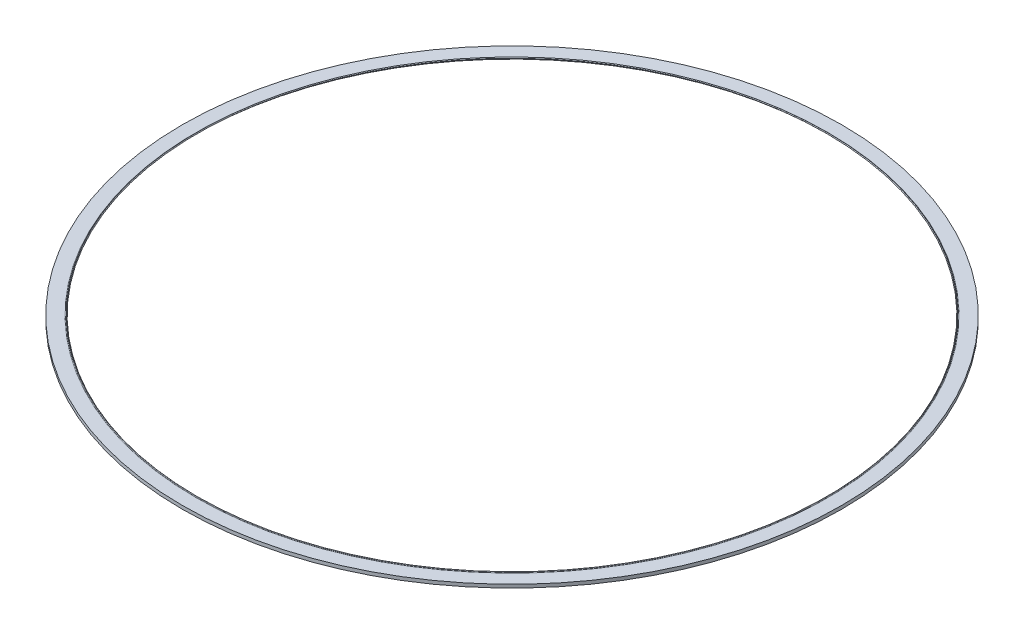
from build123d import *


with BuildPart() as part:
    # Sketch1 → Base-Revolve Seal (revolve)
    with BuildSketch(Plane.XY, mode=Mode.PRIVATE) as base_revolve_seal_sk:
        with BuildLine():
            Line((-62.6745, 0), (-60.4901, 0))
            Line((-60.4901, 0), (-60.4901, 0.4572))
            Line((-60.4901, 0.4572), (-60.102002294, 0.4572))
            ThreePointArc((-60.102002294, 0.4572), (-59.985360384, 0.480401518), (-59.886476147, 0.546473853))
            Line((-59.886476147, 0.546473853), (-59.800312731, 0.632637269))
            Line((-59.800312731, 0.632637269), (-59.922549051, 0.754873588))
            Line((-59.922549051, 0.754873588), (-60.005225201, 0.672197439))
            ThreePointArc((-60.005225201, 0.672197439), (-60.046426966, 0.644667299), (-60.095027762, 0.635))
            Line((-60.095027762, 0.635), (-62.6745, 0.635))
            Line((-62.6745, 0.635), (-62.6745, 0))
        make_face()
    revolve(base_revolve_seal_sk.sketch.rotate(Axis((0, 0, 0), (0, 1, 0)), 270), axis=Axis((0, 0, 0), (0, 1, 0)))


solid = part.part
